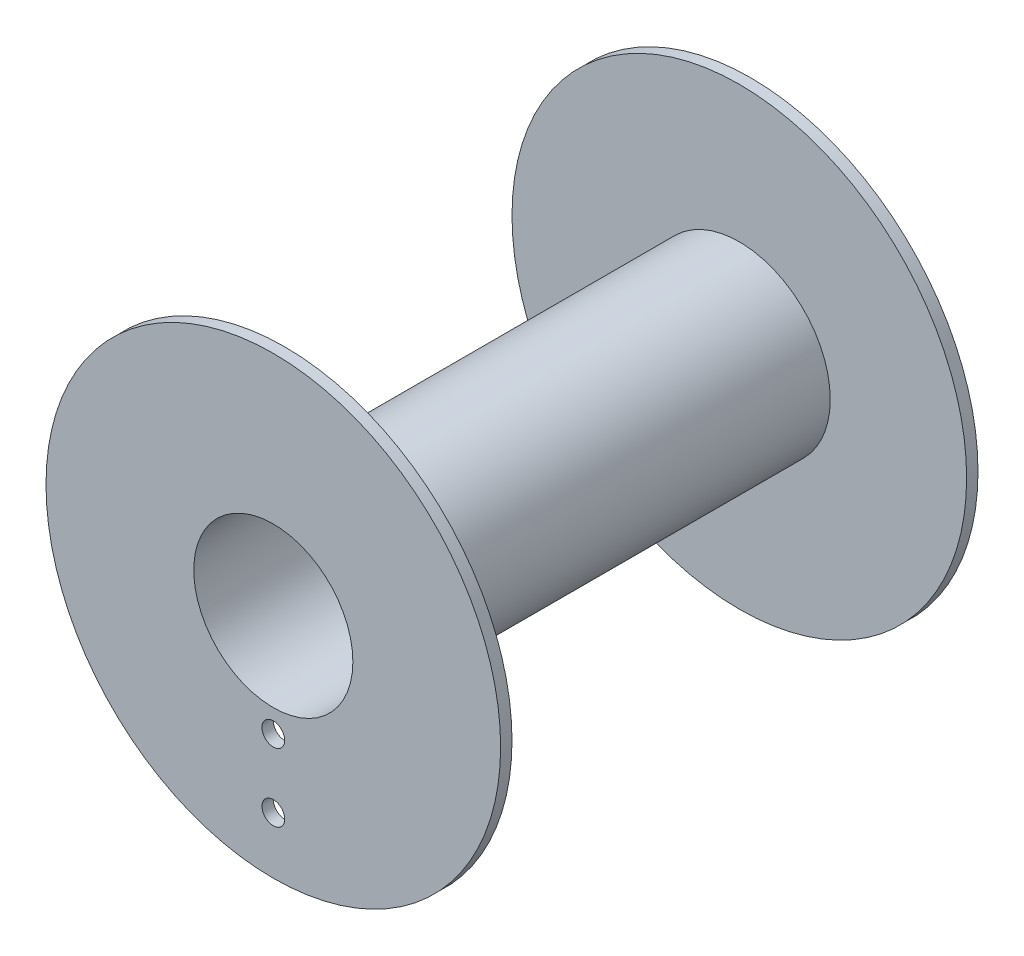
from build123d import *

# Parameters (mm, degrees)
ESQUISSE1_R             = 20
EXTRUSION1_DEPTH        = 1
ESQUISSE2_R             = 8
EXTRUSION2_DEPTH        = 40
ESQUISSE3_R             = 20
EXTRUSION3_DEPTH        = 1
ESQUISSE4_R             = 7
ENL_V_MAT_EXTRU_1_DEPTH = 51.635955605
ESQUISSE5_R             = 1
ENL_V_MAT_EXTRU_2_DEPTH = 2


with BuildPart() as part:
    # Esquisse1 → Extrusion1 (new body)
    with BuildSketch(Plane.XY):
        Circle(ESQUISSE1_R)
    extrude(amount=EXTRUSION1_DEPTH)

    # Esquisse2 → Extrusion2 (add)
    with BuildSketch(Plane.XY.offset(1)):
        Circle(ESQUISSE2_R)
    extrude(amount=EXTRUSION2_DEPTH)

    # Esquisse3 → Extrusion3 (add)
    with BuildSketch(Plane.XY.offset(41)):
        Circle(ESQUISSE3_R)
    extrude(amount=EXTRUSION3_DEPTH)

    # Esquisse4 → Enl_v. mat.-Extru.1 (cut, through all)
    with BuildSketch(Plane.XY.offset(42)):
        Circle(ESQUISSE4_R)
    extrude(amount=-ENL_V_MAT_EXTRU_1_DEPTH, mode=Mode.SUBTRACT)

    # Esquisse5 → Enl_v. mat.-Extru.2 (cut)
    with BuildSketch(Plane.XY.offset(42)):
        with Locations((0, -9)):
            Circle(ESQUISSE5_R)
        with Locations((0, -15)):
            Circle(ESQUISSE5_R)
    extrude(amount=-ENL_V_MAT_EXTRU_2_DEPTH, mode=Mode.SUBTRACT)


solid = part.part
